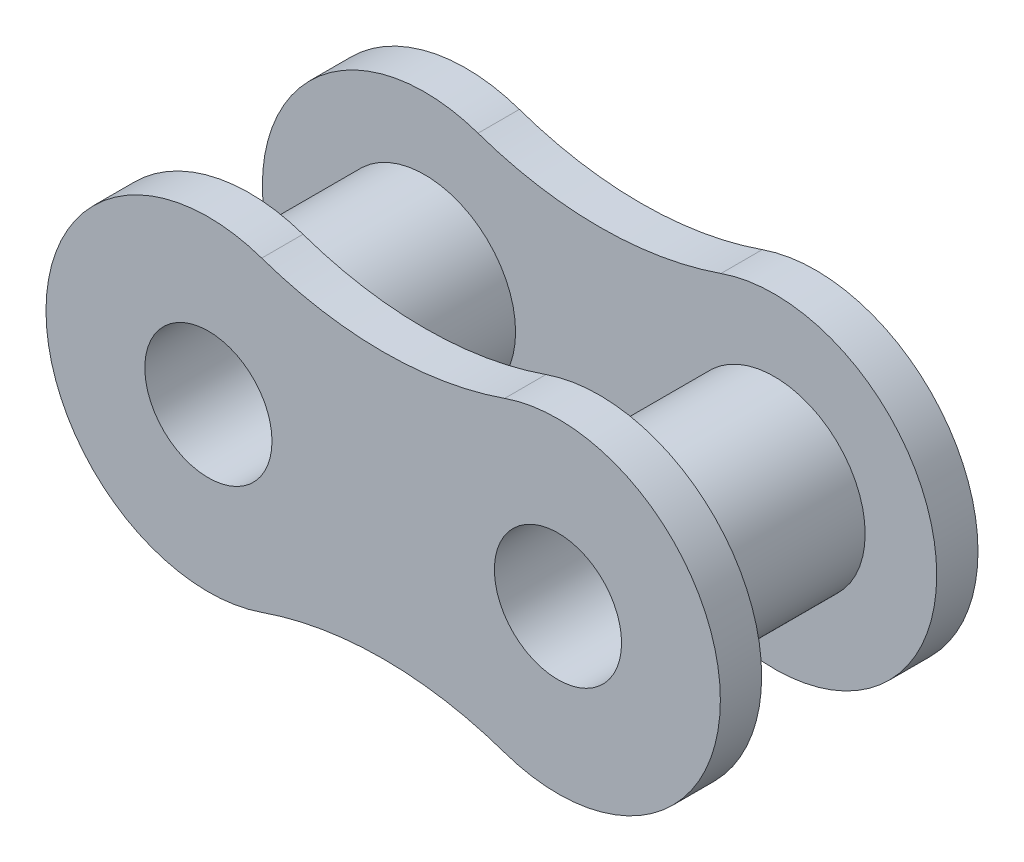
ISO-10303-21;
HEADER;
FILE_DESCRIPTION(('STEP AP214'),'2;1');
FILE_NAME('part.step','',(''),(''),'','','');
FILE_SCHEMA(('AUTOMOTIVE_DESIGN { 1 0 10303 214 1 1 1 1 }'));
ENDSEC;
DATA;
#1=APPLICATION_CONTEXT('core data for automotive mechanical design processes');
#2=APPLICATION_PROTOCOL_DEFINITION('international standard','automotive_design',2000,#1);
#3=PRODUCT_CONTEXT('',#1,'mechanical');
#4=PRODUCT('Part','Part','',(#3));
#5=PRODUCT_RELATED_PRODUCT_CATEGORY('part','',(#4));
#6=PRODUCT_DEFINITION_FORMATION('','',#4);
#7=PRODUCT_DEFINITION_CONTEXT('part definition',#1,'design');
#8=PRODUCT_DEFINITION('design','',#6,#7);
#9=PRODUCT_DEFINITION_SHAPE('','',#8);
#10=(LENGTH_UNIT() NAMED_UNIT(*) SI_UNIT(.MILLI.,.METRE.));
#11=(NAMED_UNIT(*) PLANE_ANGLE_UNIT() SI_UNIT($,.RADIAN.));
#12=(NAMED_UNIT(*) SI_UNIT($,.STERADIAN.) SOLID_ANGLE_UNIT());
#13=UNCERTAINTY_MEASURE_WITH_UNIT(LENGTH_MEASURE(1.E-05),#10,'distance_accuracy_value','');
#14=(GEOMETRIC_REPRESENTATION_CONTEXT(3) GLOBAL_UNCERTAINTY_ASSIGNED_CONTEXT((#13)) GLOBAL_UNIT_ASSIGNED_CONTEXT((#10,
#11,#12)) REPRESENTATION_CONTEXT('',''));
#15=CARTESIAN_POINT('',(0.,0.,0.));
#16=DIRECTION('',(0.,0.,1.));
#17=DIRECTION('',(1.,0.,0.));
#18=AXIS2_PLACEMENT_3D('',#15,#16,#17);
#19=CARTESIAN_POINT('',(3.17500000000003,9.13390798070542,2.34));
#20=DIRECTION('',(0.,0.,-1.));
#21=DIRECTION('',(-1.,0.,0.));
#22=AXIS2_PLACEMENT_3D('',#19,#20,#21);
#23=CYLINDRICAL_SURFACE('',#22,6.71999999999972);
#24=CARTESIAN_POINT('',(3.17500000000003,9.13390798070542,1.59));
#25=DIRECTION('',(0.,0.,1.));
#26=DIRECTION('',(-0.328335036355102,-0.94456132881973,0.));
#27=AXIS2_PLACEMENT_3D('',#24,#25,#26);
#28=CIRCLE('',#27,6.71999999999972);
#29=CARTESIAN_POINT('',(0.96858855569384,2.7864558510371,1.59));
#30=VERTEX_POINT('',#29);
#31=CARTESIAN_POINT('',(5.381411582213,2.7864558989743,1.59));
#32=VERTEX_POINT('',#31);
#33=EDGE_CURVE('E95',#30,#32,#28,.T.);
#34=ORIENTED_EDGE('',*,*,#33,.F.);
#35=DIRECTION('',(0.,0.,-1.));
#36=VECTOR('',#35,1.);
#37=CARTESIAN_POINT('',(0.96858855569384,2.7864558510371,2.34));
#38=LINE('',#37,#36);
#39=CARTESIAN_POINT('',(0.96858855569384,2.7864558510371,2.34));
#40=VERTEX_POINT('',#39);
#41=EDGE_CURVE('E84',#40,#30,#38,.T.);
#42=ORIENTED_EDGE('',*,*,#41,.F.);
#43=CARTESIAN_POINT('',(3.17500000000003,9.13390798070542,2.34));
#44=DIRECTION('',(0.,0.,1.));
#45=DIRECTION('',(-0.328335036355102,-0.94456132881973,0.));
#46=AXIS2_PLACEMENT_3D('',#43,#44,#45);
#47=CIRCLE('',#46,6.71999999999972);
#48=CARTESIAN_POINT('',(5.381411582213,2.7864558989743,2.34));
#49=VERTEX_POINT('',#48);
#50=EDGE_CURVE('E94',#40,#49,#47,.T.);
#51=ORIENTED_EDGE('',*,*,#50,.T.);
#52=DIRECTION('',(0.,0.,-1.));
#53=VECTOR('',#52,1.);
#54=CARTESIAN_POINT('',(5.381411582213,2.7864558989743,2.34));
#55=LINE('',#54,#53);
#56=EDGE_CURVE('E106',#49,#32,#55,.T.);
#57=ORIENTED_EDGE('',*,*,#56,.T.);
#58=EDGE_LOOP('',(#34,#42,#51,#57));
#59=FACE_BOUND('',#58,.T.);
#60=ADVANCED_FACE('F16',(#59),#23,.F.);
#61=CARTESIAN_POINT('',(4.7625,4.56695399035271,1.59));
#62=DIRECTION('',(0.,0.,1.));
#63=DIRECTION('',(1.,0.,0.));
#64=AXIS2_PLACEMENT_3D('',#61,#62,#63);
#65=PLANE('',#64);
#66=CARTESIAN_POINT('',(6.35,0.,1.59));
#67=DIRECTION('',(0.,0.,-1.));
#68=DIRECTION('',(1.,0.,0.));
#69=AXIS2_PLACEMENT_3D('',#66,#67,#68);
#70=CIRCLE('',#69,1.65);
#71=CARTESIAN_POINT('',(8.,0.,1.59));
#72=VERTEX_POINT('',#71);
#73=EDGE_CURVE('E117',#72,#72,#70,.T.);
#74=ORIENTED_EDGE('',*,*,#73,.F.);
#75=EDGE_LOOP('',(#74));
#76=FACE_BOUND('',#75,.T.);
#77=CARTESIAN_POINT('',(0.,0.,1.59));
#78=DIRECTION('',(0.,0.,-1.));
#79=DIRECTION('',(1.,0.,0.));
#80=AXIS2_PLACEMENT_3D('',#77,#78,#79);
#81=CIRCLE('',#80,1.65);
#82=CARTESIAN_POINT('',(1.65,0.,1.59));
#83=VERTEX_POINT('',#82);
#84=EDGE_CURVE('E122',#83,#83,#81,.T.);
#85=ORIENTED_EDGE('',*,*,#84,.F.);
#86=EDGE_LOOP('',(#85));
#87=FACE_BOUND('',#86,.T.);
#88=ORIENTED_EDGE('',*,*,#33,.T.);
#89=CARTESIAN_POINT('',(6.35,0.,1.59));
#90=DIRECTION('',(0.,0.,1.));
#91=DIRECTION('',(-0.328335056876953,-0.944561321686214,0.));
#92=AXIS2_PLACEMENT_3D('',#89,#90,#91);
#93=CIRCLE('',#92,2.95);
#94=CARTESIAN_POINT('',(5.381411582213,-2.7864558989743,1.59));
#95=VERTEX_POINT('',#94);
#96=EDGE_CURVE('E125',#95,#32,#93,.T.);
#97=ORIENTED_EDGE('',*,*,#96,.F.);
#98=CARTESIAN_POINT('',(3.1750000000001,-9.13390798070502,1.59));
#99=DIRECTION('',(0.,0.,1.));
#100=DIRECTION('',(0.328335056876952,0.944561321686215,0.));
#101=AXIS2_PLACEMENT_3D('',#98,#99,#100);
#102=CIRCLE('',#101,6.71999999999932);
#103=CARTESIAN_POINT('',(0.968588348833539,-2.786455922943,1.59));
#104=VERTEX_POINT('',#103);
#105=EDGE_CURVE('E102',#95,#104,#102,.T.);
#106=ORIENTED_EDGE('',*,*,#105,.T.);
#107=CARTESIAN_POINT('',(0.,0.,1.59));
#108=DIRECTION('',(0.,0.,1.));
#109=DIRECTION('',(0.328335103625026,0.944561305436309,0.));
#110=AXIS2_PLACEMENT_3D('',#107,#108,#109);
#111=CIRCLE('',#110,2.95);
#112=EDGE_CURVE('E88',#30,#104,#111,.T.);
#113=ORIENTED_EDGE('',*,*,#112,.F.);
#114=EDGE_LOOP('',(#88,#97,#106,#113));
#115=FACE_BOUND('',#114,.T.);
#116=ADVANCED_FACE('F100',(#76,#87,#115),#65,.F.);
#117=CARTESIAN_POINT('',(0.,0.,2.34));
#118=DIRECTION('',(0.,0.,-1.));
#119=DIRECTION('',(-1.,0.,0.));
#120=AXIS2_PLACEMENT_3D('',#117,#118,#119);
#121=CYLINDRICAL_SURFACE('',#120,2.95);
#122=ORIENTED_EDGE('',*,*,#112,.T.);
#123=DIRECTION('',(0.,0.,-1.));
#124=VECTOR('',#123,1.);
#125=CARTESIAN_POINT('',(0.968588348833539,-2.786455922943,2.34));
#126=LINE('',#125,#124);
#127=CARTESIAN_POINT('',(0.968588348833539,-2.786455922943,2.34));
#128=VERTEX_POINT('',#127);
#129=EDGE_CURVE('E103',#128,#104,#126,.T.);
#130=ORIENTED_EDGE('',*,*,#129,.F.);
#131=CARTESIAN_POINT('',(0.,0.,2.34));
#132=DIRECTION('',(0.,0.,1.));
#133=DIRECTION('',(0.328335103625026,0.944561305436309,0.));
#134=AXIS2_PLACEMENT_3D('',#131,#132,#133);
#135=CIRCLE('',#134,2.95);
#136=EDGE_CURVE('E90',#40,#128,#135,.T.);
#137=ORIENTED_EDGE('',*,*,#136,.F.);
#138=ORIENTED_EDGE('',*,*,#41,.T.);
#139=EDGE_LOOP('',(#122,#130,#137,#138));
#140=FACE_BOUND('',#139,.T.);
#141=ADVANCED_FACE('F86',(#140),#121,.T.);
#142=CARTESIAN_POINT('',(4.7625,4.56695399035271,2.34));
#143=DIRECTION('',(0.,0.,1.));
#144=DIRECTION('',(1.,0.,0.));
#145=AXIS2_PLACEMENT_3D('',#142,#143,#144);
#146=PLANE('',#145);
#147=CARTESIAN_POINT('',(6.35,0.,2.34));
#148=DIRECTION('',(0.,0.,-1.));
#149=DIRECTION('',(1.,0.,0.));
#150=AXIS2_PLACEMENT_3D('',#147,#148,#149);
#151=CIRCLE('',#150,1.155);
#152=CARTESIAN_POINT('',(7.505,0.,2.34));
#153=VERTEX_POINT('',#152);
#154=EDGE_CURVE('E138',#153,#153,#151,.T.);
#155=ORIENTED_EDGE('',*,*,#154,.T.);
#156=EDGE_LOOP('',(#155));
#157=FACE_BOUND('',#156,.T.);
#158=CARTESIAN_POINT('',(0.,0.,2.34));
#159=DIRECTION('',(0.,0.,-1.));
#160=DIRECTION('',(1.,0.,0.));
#161=AXIS2_PLACEMENT_3D('',#158,#159,#160);
#162=CIRCLE('',#161,1.155);
#163=CARTESIAN_POINT('',(1.155,0.,2.34));
#164=VERTEX_POINT('',#163);
#165=EDGE_CURVE('E143',#164,#164,#162,.T.);
#166=ORIENTED_EDGE('',*,*,#165,.T.);
#167=EDGE_LOOP('',(#166));
#168=FACE_BOUND('',#167,.T.);
#169=ORIENTED_EDGE('',*,*,#50,.F.);
#170=ORIENTED_EDGE('',*,*,#136,.T.);
#171=CARTESIAN_POINT('',(3.1750000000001,-9.13390798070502,2.34));
#172=DIRECTION('',(0.,0.,1.));
#173=DIRECTION('',(0.328335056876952,0.944561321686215,0.));
#174=AXIS2_PLACEMENT_3D('',#171,#172,#173);
#175=CIRCLE('',#174,6.71999999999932);
#176=CARTESIAN_POINT('',(5.381411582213,-2.7864558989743,2.34));
#177=VERTEX_POINT('',#176);
#178=EDGE_CURVE('E146',#177,#128,#175,.T.);
#179=ORIENTED_EDGE('',*,*,#178,.F.);
#180=CARTESIAN_POINT('',(6.35,0.,2.34));
#181=DIRECTION('',(0.,0.,1.));
#182=DIRECTION('',(-0.328335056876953,-0.944561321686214,0.));
#183=AXIS2_PLACEMENT_3D('',#180,#181,#182);
#184=CIRCLE('',#183,2.95);
#185=EDGE_CURVE('E148',#177,#49,#184,.T.);
#186=ORIENTED_EDGE('',*,*,#185,.T.);
#187=EDGE_LOOP('',(#169,#170,#179,#186));
#188=FACE_BOUND('',#187,.T.);
#189=ADVANCED_FACE('F246',(#157,#168,#188),#146,.T.);
#190=CARTESIAN_POINT('',(6.35,0.,2.34));
#191=DIRECTION('',(0.,0.,-1.));
#192=DIRECTION('',(-1.,0.,0.));
#193=AXIS2_PLACEMENT_3D('',#190,#191,#192);
#194=CYLINDRICAL_SURFACE('',#193,2.95);
#195=ORIENTED_EDGE('',*,*,#96,.T.);
#196=ORIENTED_EDGE('',*,*,#56,.F.);
#197=ORIENTED_EDGE('',*,*,#185,.F.);
#198=DIRECTION('',(0.,0.,-1.));
#199=VECTOR('',#198,1.);
#200=CARTESIAN_POINT('',(5.381411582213,-2.7864558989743,2.34));
#201=LINE('',#200,#199);
#202=EDGE_CURVE('E153',#177,#95,#201,.T.);
#203=ORIENTED_EDGE('',*,*,#202,.T.);
#204=EDGE_LOOP('',(#195,#196,#197,#203));
#205=FACE_BOUND('',#204,.T.);
#206=ADVANCED_FACE('F249',(#205),#194,.T.);
#207=CARTESIAN_POINT('',(6.35,0.,1.965));
#208=DIRECTION('',(0.,0.,1.));
#209=DIRECTION('',(1.,0.,0.));
#210=AXIS2_PLACEMENT_3D('',#207,#208,#209);
#211=CYLINDRICAL_SURFACE('',#210,1.65);
#212=ORIENTED_EDGE('',*,*,#73,.T.);
#213=EDGE_LOOP('',(#212));
#214=FACE_BOUND('',#213,.T.);
#215=CARTESIAN_POINT('',(6.35,0.,-1.59));
#216=DIRECTION('',(0.,0.,1.));
#217=DIRECTION('',(1.,0.,0.));
#218=AXIS2_PLACEMENT_3D('',#215,#216,#217);
#219=CIRCLE('',#218,1.65);
#220=CARTESIAN_POINT('',(8.,0.,-1.59));
#221=VERTEX_POINT('',#220);
#222=EDGE_CURVE('E158',#221,#221,#219,.T.);
#223=ORIENTED_EDGE('',*,*,#222,.T.);
#224=EDGE_LOOP('',(#223));
#225=FACE_BOUND('',#224,.T.);
#226=ADVANCED_FACE('F253',(#214,#225),#211,.T.);
#227=CARTESIAN_POINT('',(0.,0.,1.965));
#228=DIRECTION('',(0.,0.,1.));
#229=DIRECTION('',(1.,0.,0.));
#230=AXIS2_PLACEMENT_3D('',#227,#228,#229);
#231=CYLINDRICAL_SURFACE('',#230,1.65);
#232=ORIENTED_EDGE('',*,*,#84,.T.);
#233=EDGE_LOOP('',(#232));
#234=FACE_BOUND('',#233,.T.);
#235=CARTESIAN_POINT('',(0.,0.,-1.59));
#236=DIRECTION('',(0.,0.,1.));
#237=DIRECTION('',(1.,0.,0.));
#238=AXIS2_PLACEMENT_3D('',#235,#236,#237);
#239=CIRCLE('',#238,1.65);
#240=CARTESIAN_POINT('',(1.65,0.,-1.59));
#241=VERTEX_POINT('',#240);
#242=EDGE_CURVE('E163',#241,#241,#239,.T.);
#243=ORIENTED_EDGE('',*,*,#242,.T.);
#244=EDGE_LOOP('',(#243));
#245=FACE_BOUND('',#244,.T.);
#246=ADVANCED_FACE('F257',(#234,#245),#231,.T.);
#247=CARTESIAN_POINT('',(3.1750000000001,-9.13390798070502,2.34));
#248=DIRECTION('',(0.,0.,-1.));
#249=DIRECTION('',(-1.,0.,0.));
#250=AXIS2_PLACEMENT_3D('',#247,#248,#249);
#251=CYLINDRICAL_SURFACE('',#250,6.71999999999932);
#252=ORIENTED_EDGE('',*,*,#105,.F.);
#253=ORIENTED_EDGE('',*,*,#202,.F.);
#254=ORIENTED_EDGE('',*,*,#178,.T.);
#255=ORIENTED_EDGE('',*,*,#129,.T.);
#256=EDGE_LOOP('',(#252,#253,#254,#255));
#257=FACE_BOUND('',#256,.T.);
#258=ADVANCED_FACE('F261',(#257),#251,.F.);
#259=CARTESIAN_POINT('',(6.35,0.,3.09));
#260=DIRECTION('',(0.,0.,1.));
#261=DIRECTION('',(1.,0.,0.));
#262=AXIS2_PLACEMENT_3D('',#259,#260,#261);
#263=CYLINDRICAL_SURFACE('',#262,1.155);
#264=ORIENTED_EDGE('',*,*,#154,.F.);
#265=EDGE_LOOP('',(#264));
#266=FACE_BOUND('',#265,.T.);
#267=CARTESIAN_POINT('',(6.35,0.,-2.34));
#268=DIRECTION('',(0.,0.,-1.));
#269=DIRECTION('',(1.,0.,0.));
#270=AXIS2_PLACEMENT_3D('',#267,#268,#269);
#271=CIRCLE('',#270,1.155);
#272=CARTESIAN_POINT('',(7.505,0.,-2.34));
#273=VERTEX_POINT('',#272);
#274=EDGE_CURVE('E166',#273,#273,#271,.T.);
#275=ORIENTED_EDGE('',*,*,#274,.T.);
#276=EDGE_LOOP('',(#275));
#277=FACE_BOUND('',#276,.T.);
#278=ADVANCED_FACE('F265',(#266,#277),#263,.F.);
#279=CARTESIAN_POINT('',(0.,0.,3.09));
#280=DIRECTION('',(0.,0.,1.));
#281=DIRECTION('',(1.,0.,0.));
#282=AXIS2_PLACEMENT_3D('',#279,#280,#281);
#283=CYLINDRICAL_SURFACE('',#282,1.155);
#284=ORIENTED_EDGE('',*,*,#165,.F.);
#285=EDGE_LOOP('',(#284));
#286=FACE_BOUND('',#285,.T.);
#287=CARTESIAN_POINT('',(0.,0.,-2.34));
#288=DIRECTION('',(0.,0.,-1.));
#289=DIRECTION('',(1.,0.,0.));
#290=AXIS2_PLACEMENT_3D('',#287,#288,#289);
#291=CIRCLE('',#290,1.155);
#292=CARTESIAN_POINT('',(1.155,0.,-2.34));
#293=VERTEX_POINT('',#292);
#294=EDGE_CURVE('E169',#293,#293,#291,.T.);
#295=ORIENTED_EDGE('',*,*,#294,.T.);
#296=EDGE_LOOP('',(#295));
#297=FACE_BOUND('',#296,.T.);
#298=ADVANCED_FACE('F269',(#286,#297),#283,.F.);
#299=CARTESIAN_POINT('',(4.7625,4.56695399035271,-1.59));
#300=DIRECTION('',(0.,0.,1.));
#301=DIRECTION('',(1.,0.,0.));
#302=AXIS2_PLACEMENT_3D('',#299,#300,#301);
#303=PLANE('',#302);
#304=ORIENTED_EDGE('',*,*,#242,.F.);
#305=EDGE_LOOP('',(#304));
#306=FACE_BOUND('',#305,.T.);
#307=ORIENTED_EDGE('',*,*,#222,.F.);
#308=EDGE_LOOP('',(#307));
#309=FACE_BOUND('',#308,.T.);
#310=CARTESIAN_POINT('',(3.17500000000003,9.13390798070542,-1.59));
#311=DIRECTION('',(0.,0.,1.));
#312=DIRECTION('',(-0.328335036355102,-0.94456132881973,0.));
#313=AXIS2_PLACEMENT_3D('',#310,#311,#312);
#314=CIRCLE('',#313,6.71999999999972);
#315=CARTESIAN_POINT('',(0.96858855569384,2.7864558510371,-1.59));
#316=VERTEX_POINT('',#315);
#317=CARTESIAN_POINT('',(5.381411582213,2.7864558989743,-1.59));
#318=VERTEX_POINT('',#317);
#319=EDGE_CURVE('E172',#316,#318,#314,.T.);
#320=ORIENTED_EDGE('',*,*,#319,.F.);
#321=CARTESIAN_POINT('',(0.,0.,-1.59));
#322=DIRECTION('',(0.,0.,1.));
#323=DIRECTION('',(0.328335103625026,0.944561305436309,0.));
#324=AXIS2_PLACEMENT_3D('',#321,#322,#323);
#325=CIRCLE('',#324,2.95);
#326=CARTESIAN_POINT('',(0.968588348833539,-2.786455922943,-1.59));
#327=VERTEX_POINT('',#326);
#328=EDGE_CURVE('E175',#316,#327,#325,.T.);
#329=ORIENTED_EDGE('',*,*,#328,.T.);
#330=CARTESIAN_POINT('',(3.1750000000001,-9.13390798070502,-1.59));
#331=DIRECTION('',(0.,0.,1.));
#332=DIRECTION('',(0.328335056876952,0.944561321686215,0.));
#333=AXIS2_PLACEMENT_3D('',#330,#331,#332);
#334=CIRCLE('',#333,6.71999999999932);
#335=CARTESIAN_POINT('',(5.381411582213,-2.7864558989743,-1.59));
#336=VERTEX_POINT('',#335);
#337=EDGE_CURVE('E180',#336,#327,#334,.T.);
#338=ORIENTED_EDGE('',*,*,#337,.F.);
#339=CARTESIAN_POINT('',(6.35,0.,-1.59));
#340=DIRECTION('',(0.,0.,1.));
#341=DIRECTION('',(-0.328335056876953,-0.944561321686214,0.));
#342=AXIS2_PLACEMENT_3D('',#339,#340,#341);
#343=CIRCLE('',#342,2.95);
#344=EDGE_CURVE('E184',#336,#318,#343,.T.);
#345=ORIENTED_EDGE('',*,*,#344,.T.);
#346=EDGE_LOOP('',(#320,#329,#338,#345));
#347=FACE_BOUND('',#346,.T.);
#348=ADVANCED_FACE('F221',(#306,#309,#347),#303,.T.);
#349=CARTESIAN_POINT('',(4.7625,4.56695399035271,-2.34));
#350=DIRECTION('',(0.,0.,1.));
#351=DIRECTION('',(1.,0.,0.));
#352=AXIS2_PLACEMENT_3D('',#349,#350,#351);
#353=PLANE('',#352);
#354=ORIENTED_EDGE('',*,*,#274,.F.);
#355=EDGE_LOOP('',(#354));
#356=FACE_BOUND('',#355,.T.);
#357=ORIENTED_EDGE('',*,*,#294,.F.);
#358=EDGE_LOOP('',(#357));
#359=FACE_BOUND('',#358,.T.);
#360=CARTESIAN_POINT('',(3.17500000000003,9.13390798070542,-2.34));
#361=DIRECTION('',(0.,0.,1.));
#362=DIRECTION('',(-0.328335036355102,-0.94456132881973,0.));
#363=AXIS2_PLACEMENT_3D('',#360,#361,#362);
#364=CIRCLE('',#363,6.71999999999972);
#365=CARTESIAN_POINT('',(0.96858855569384,2.7864558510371,-2.34));
#366=VERTEX_POINT('',#365);
#367=CARTESIAN_POINT('',(5.381411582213,2.7864558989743,-2.34));
#368=VERTEX_POINT('',#367);
#369=EDGE_CURVE('E189',#366,#368,#364,.T.);
#370=ORIENTED_EDGE('',*,*,#369,.T.);
#371=CARTESIAN_POINT('',(6.35,0.,-2.34));
#372=DIRECTION('',(0.,0.,1.));
#373=DIRECTION('',(-0.328335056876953,-0.944561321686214,0.));
#374=AXIS2_PLACEMENT_3D('',#371,#372,#373);
#375=CIRCLE('',#374,2.95);
#376=CARTESIAN_POINT('',(5.381411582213,-2.7864558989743,-2.34));
#377=VERTEX_POINT('',#376);
#378=EDGE_CURVE('E194',#377,#368,#375,.T.);
#379=ORIENTED_EDGE('',*,*,#378,.F.);
#380=CARTESIAN_POINT('',(3.1750000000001,-9.13390798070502,-2.34));
#381=DIRECTION('',(0.,0.,1.));
#382=DIRECTION('',(0.328335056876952,0.944561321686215,0.));
#383=AXIS2_PLACEMENT_3D('',#380,#381,#382);
#384=CIRCLE('',#383,6.71999999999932);
#385=CARTESIAN_POINT('',(0.968588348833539,-2.786455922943,-2.34));
#386=VERTEX_POINT('',#385);
#387=EDGE_CURVE('E198',#377,#386,#384,.T.);
#388=ORIENTED_EDGE('',*,*,#387,.T.);
#389=CARTESIAN_POINT('',(0.,0.,-2.34));
#390=DIRECTION('',(0.,0.,1.));
#391=DIRECTION('',(0.328335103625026,0.944561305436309,0.));
#392=AXIS2_PLACEMENT_3D('',#389,#390,#391);
#393=CIRCLE('',#392,2.95);
#394=EDGE_CURVE('E202',#366,#386,#393,.T.);
#395=ORIENTED_EDGE('',*,*,#394,.F.);
#396=EDGE_LOOP('',(#370,#379,#388,#395));
#397=FACE_BOUND('',#396,.T.);
#398=ADVANCED_FACE('F228',(#356,#359,#397),#353,.F.);
#399=CARTESIAN_POINT('',(3.17500000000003,9.13390798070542,-2.34));
#400=DIRECTION('',(0.,0.,1.));
#401=DIRECTION('',(1.,0.,0.));
#402=AXIS2_PLACEMENT_3D('',#399,#400,#401);
#403=CYLINDRICAL_SURFACE('',#402,6.71999999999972);
#404=ORIENTED_EDGE('',*,*,#319,.T.);
#405=DIRECTION('',(0.,0.,1.));
#406=VECTOR('',#405,1.);
#407=CARTESIAN_POINT('',(5.381411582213,2.7864558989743,-2.34));
#408=LINE('',#407,#406);
#409=EDGE_CURVE('E206',#368,#318,#408,.T.);
#410=ORIENTED_EDGE('',*,*,#409,.F.);
#411=ORIENTED_EDGE('',*,*,#369,.F.);
#412=DIRECTION('',(0.,0.,1.));
#413=VECTOR('',#412,1.);
#414=CARTESIAN_POINT('',(0.96858855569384,2.7864558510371,-2.34));
#415=LINE('',#414,#413);
#416=EDGE_CURVE('E32',#366,#316,#415,.T.);
#417=ORIENTED_EDGE('',*,*,#416,.T.);
#418=EDGE_LOOP('',(#404,#410,#411,#417));
#419=FACE_BOUND('',#418,.T.);
#420=ADVANCED_FACE('F224',(#419),#403,.F.);
#421=CARTESIAN_POINT('',(0.,0.,-2.34));
#422=DIRECTION('',(0.,0.,1.));
#423=DIRECTION('',(1.,0.,0.));
#424=AXIS2_PLACEMENT_3D('',#421,#422,#423);
#425=CYLINDRICAL_SURFACE('',#424,2.95);
#426=ORIENTED_EDGE('',*,*,#328,.F.);
#427=ORIENTED_EDGE('',*,*,#416,.F.);
#428=ORIENTED_EDGE('',*,*,#394,.T.);
#429=DIRECTION('',(0.,0.,1.));
#430=VECTOR('',#429,1.);
#431=CARTESIAN_POINT('',(0.968588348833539,-2.786455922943,-2.34));
#432=LINE('',#431,#430);
#433=EDGE_CURVE('E25',#386,#327,#432,.T.);
#434=ORIENTED_EDGE('',*,*,#433,.T.);
#435=EDGE_LOOP('',(#426,#427,#428,#434));
#436=FACE_BOUND('',#435,.T.);
#437=ADVANCED_FACE('F217',(#436),#425,.T.);
#438=CARTESIAN_POINT('',(3.1750000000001,-9.13390798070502,-2.34));
#439=DIRECTION('',(0.,0.,1.));
#440=DIRECTION('',(1.,0.,0.));
#441=AXIS2_PLACEMENT_3D('',#438,#439,#440);
#442=CYLINDRICAL_SURFACE('',#441,6.71999999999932);
#443=ORIENTED_EDGE('',*,*,#337,.T.);
#444=ORIENTED_EDGE('',*,*,#433,.F.);
#445=ORIENTED_EDGE('',*,*,#387,.F.);
#446=DIRECTION('',(0.,0.,1.));
#447=VECTOR('',#446,1.);
#448=CARTESIAN_POINT('',(5.381411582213,-2.7864558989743,-2.34));
#449=LINE('',#448,#447);
#450=EDGE_CURVE('E11',#377,#336,#449,.T.);
#451=ORIENTED_EDGE('',*,*,#450,.T.);
#452=EDGE_LOOP('',(#443,#444,#445,#451));
#453=FACE_BOUND('',#452,.T.);
#454=ADVANCED_FACE('F229',(#453),#442,.F.);
#455=CARTESIAN_POINT('',(6.35,0.,-2.34));
#456=DIRECTION('',(0.,0.,1.));
#457=DIRECTION('',(1.,0.,0.));
#458=AXIS2_PLACEMENT_3D('',#455,#456,#457);
#459=CYLINDRICAL_SURFACE('',#458,2.95);
#460=ORIENTED_EDGE('',*,*,#344,.F.);
#461=ORIENTED_EDGE('',*,*,#450,.F.);
#462=ORIENTED_EDGE('',*,*,#378,.T.);
#463=ORIENTED_EDGE('',*,*,#409,.T.);
#464=EDGE_LOOP('',(#460,#461,#462,#463));
#465=FACE_BOUND('',#464,.T.);
#466=ADVANCED_FACE('F18',(#465),#459,.T.);
#467=CLOSED_SHELL('',(#60,#116,#141,#189,#206,#226,#246,#258,#278,#298,#348,#398,#420,#437,#454,#466));
#468=MANIFOLD_SOLID_BREP('B1',#467);
#469=ADVANCED_BREP_SHAPE_REPRESENTATION('',(#18,#468),#14);
#470=SHAPE_DEFINITION_REPRESENTATION(#9,#469);
ENDSEC;
END-ISO-10303-21;
